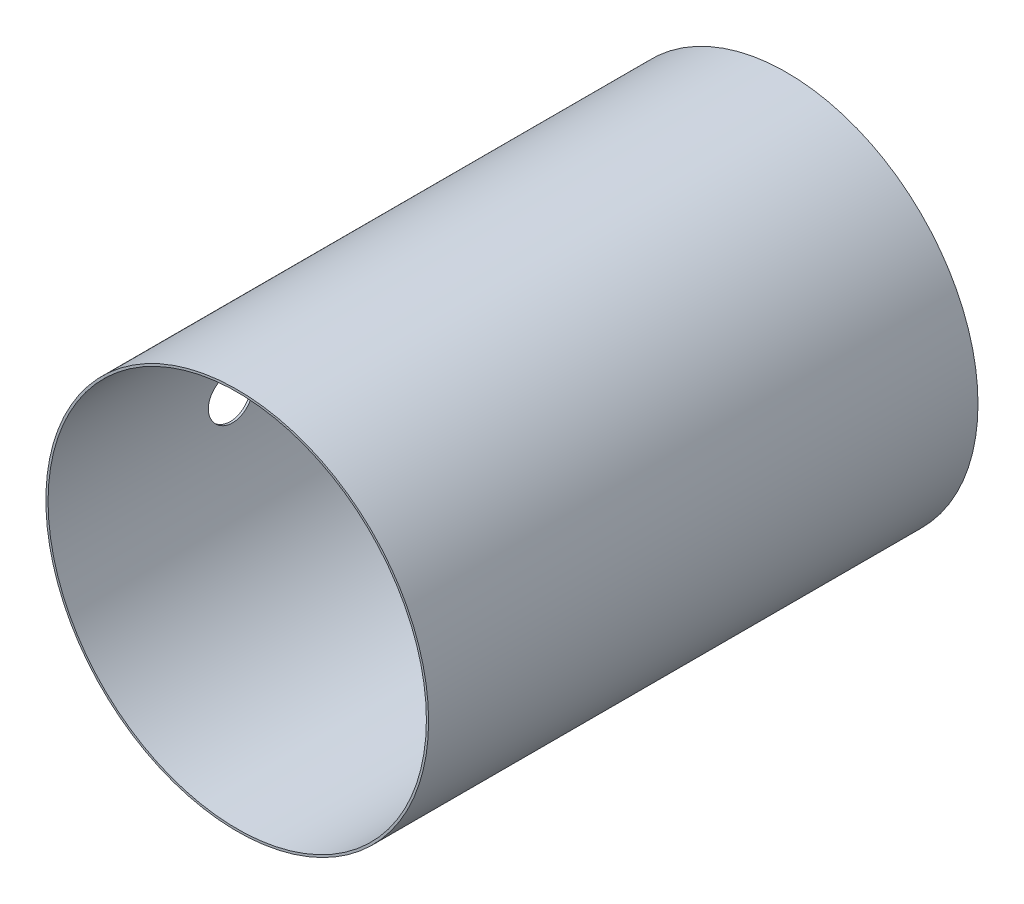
ISO-10303-21;
HEADER;
FILE_DESCRIPTION(('STEP AP214'),'2;1');
FILE_NAME('part.step','',(''),(''),'','','');
FILE_SCHEMA(('AUTOMOTIVE_DESIGN { 1 0 10303 214 1 1 1 1 }'));
ENDSEC;
DATA;
#1=APPLICATION_CONTEXT('core data for automotive mechanical design processes');
#2=APPLICATION_PROTOCOL_DEFINITION('international standard','automotive_design',2000,#1);
#3=PRODUCT_CONTEXT('',#1,'mechanical');
#4=PRODUCT('Part','Part','',(#3));
#5=PRODUCT_RELATED_PRODUCT_CATEGORY('part','',(#4));
#6=PRODUCT_DEFINITION_FORMATION('','',#4);
#7=PRODUCT_DEFINITION_CONTEXT('part definition',#1,'design');
#8=PRODUCT_DEFINITION('design','',#6,#7);
#9=PRODUCT_DEFINITION_SHAPE('','',#8);
#10=(LENGTH_UNIT() NAMED_UNIT(*) SI_UNIT(.MILLI.,.METRE.));
#11=(NAMED_UNIT(*) PLANE_ANGLE_UNIT() SI_UNIT($,.RADIAN.));
#12=(NAMED_UNIT(*) SI_UNIT($,.STERADIAN.) SOLID_ANGLE_UNIT());
#13=UNCERTAINTY_MEASURE_WITH_UNIT(LENGTH_MEASURE(1.E-05),#10,'distance_accuracy_value','');
#14=(GEOMETRIC_REPRESENTATION_CONTEXT(3) GLOBAL_UNCERTAINTY_ASSIGNED_CONTEXT((#13)) GLOBAL_UNIT_ASSIGNED_CONTEXT((#10,
#11,#12)) REPRESENTATION_CONTEXT('',''));
#15=CARTESIAN_POINT('',(0.,0.,0.));
#16=DIRECTION('',(0.,0.,1.));
#17=DIRECTION('',(1.,0.,0.));
#18=AXIS2_PLACEMENT_3D('',#15,#16,#17);
#19=CARTESIAN_POINT('',(0.,0.,1500.));
#20=DIRECTION('',(0.,0.,1.));
#21=DIRECTION('',(1.,0.,0.));
#22=AXIS2_PLACEMENT_3D('',#19,#20,#21);
#23=PLANE('',#22);
#24=CARTESIAN_POINT('',(0.,0.,1500.));
#25=DIRECTION('',(0.,0.,1.));
#26=DIRECTION('',(1.,0.,0.));
#27=AXIS2_PLACEMENT_3D('',#24,#25,#26);
#28=CIRCLE('',#27,522.5);
#29=CARTESIAN_POINT('',(522.5,0.,1500.));
#30=VERTEX_POINT('',#29);
#31=EDGE_CURVE('E12',#30,#30,#28,.T.);
#32=ORIENTED_EDGE('',*,*,#31,.T.);
#33=EDGE_LOOP('',(#32));
#34=FACE_BOUND('',#33,.T.);
#35=CARTESIAN_POINT('',(0.,0.,1500.));
#36=DIRECTION('',(0.,0.,1.));
#37=DIRECTION('',(1.,0.,0.));
#38=AXIS2_PLACEMENT_3D('',#35,#36,#37);
#39=CIRCLE('',#38,516.5);
#40=CARTESIAN_POINT('',(516.5,0.,1500.));
#41=VERTEX_POINT('',#40);
#42=EDGE_CURVE('E70',#41,#41,#39,.T.);
#43=ORIENTED_EDGE('',*,*,#42,.F.);
#44=EDGE_LOOP('',(#43));
#45=FACE_BOUND('',#44,.T.);
#46=ADVANCED_FACE('F48',(#34,#45),#23,.T.);
#47=CARTESIAN_POINT('',(0.,0.,0.));
#48=DIRECTION('',(0.,0.,1.));
#49=DIRECTION('',(1.,0.,0.));
#50=AXIS2_PLACEMENT_3D('',#47,#48,#49);
#51=PLANE('',#50);
#52=CARTESIAN_POINT('',(0.,0.,0.));
#53=DIRECTION('',(0.,0.,1.));
#54=DIRECTION('',(1.,0.,0.));
#55=AXIS2_PLACEMENT_3D('',#52,#53,#54);
#56=CIRCLE('',#55,522.5);
#57=CARTESIAN_POINT('',(522.5,0.,0.));
#58=VERTEX_POINT('',#57);
#59=EDGE_CURVE('E63',#58,#58,#56,.T.);
#60=ORIENTED_EDGE('',*,*,#59,.F.);
#61=EDGE_LOOP('',(#60));
#62=FACE_BOUND('',#61,.T.);
#63=CARTESIAN_POINT('',(0.,0.,0.));
#64=DIRECTION('',(0.,0.,1.));
#65=DIRECTION('',(1.,0.,0.));
#66=AXIS2_PLACEMENT_3D('',#63,#64,#65);
#67=CIRCLE('',#66,516.5);
#68=CARTESIAN_POINT('',(516.5,0.,0.));
#69=VERTEX_POINT('',#68);
#70=EDGE_CURVE('E73',#69,#69,#67,.T.);
#71=ORIENTED_EDGE('',*,*,#70,.T.);
#72=EDGE_LOOP('',(#71));
#73=FACE_BOUND('',#72,.T.);
#74=ADVANCED_FACE('F116',(#62,#73),#51,.F.);
#75=CARTESIAN_POINT('',(0.,0.,1500.));
#76=DIRECTION('',(0.,0.,-1.));
#77=DIRECTION('',(-1.,0.,0.));
#78=AXIS2_PLACEMENT_3D('',#75,#76,#77);
#79=CYLINDRICAL_SURFACE('',#78,522.5);
#80=CARTESIAN_POINT('',(-522.5,0.,937.5));
#81=CARTESIAN_POINT('',(-522.499996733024,1.74890557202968,937.500011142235));
#82=CARTESIAN_POINT('',(-522.491195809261,3.49810491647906,937.57347101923));
#83=CARTESIAN_POINT('',(-522.456228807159,6.98425113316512,937.866823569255));
#84=CARTESIAN_POINT('',(-522.430058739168,8.72119509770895,938.086749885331));
#85=CARTESIAN_POINT('',(-522.361058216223,12.1719122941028,938.67170652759));
#86=CARTESIAN_POINT('',(-522.318211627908,13.8856614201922,939.036877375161));
#87=CARTESIAN_POINT('',(-522.217070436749,17.2759258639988,939.909599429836));
#88=CARTESIAN_POINT('',(-522.158776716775,18.9524433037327,940.417142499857));
#89=CARTESIAN_POINT('',(-522.028423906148,22.2554449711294,941.570527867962));
#90=CARTESIAN_POINT('',(-521.95637367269,23.8819606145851,942.216281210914));
#91=CARTESIAN_POINT('',(-521.800504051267,27.0746896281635,943.641615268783));
#92=CARTESIAN_POINT('',(-521.716684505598,28.6409021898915,944.421197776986));
#93=CARTESIAN_POINT('',(-521.539640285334,31.7017923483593,946.108444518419));
#94=CARTESIAN_POINT('',(-521.446417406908,33.19648352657,947.016084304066));
#95=CARTESIAN_POINT('',(-521.253157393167,36.1042863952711,948.95313521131));
#96=CARTESIAN_POINT('',(-521.153120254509,37.5173980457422,949.982546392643));
#97=CARTESIAN_POINT('',(-520.9485619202,40.2584597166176,952.160844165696));
#98=CARTESIAN_POINT('',(-520.844022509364,41.5859961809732,953.31024947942));
#99=CARTESIAN_POINT('',(-520.633828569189,44.1396459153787,955.716599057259));
#100=CARTESIAN_POINT('',(-520.528174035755,45.3657588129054,956.973543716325));
#101=CARTESIAN_POINT('',(-520.318724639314,47.7080480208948,959.586259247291));
#102=CARTESIAN_POINT('',(-520.214929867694,48.8242189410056,960.942034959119));
#103=CARTESIAN_POINT('',(-520.012140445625,50.9387109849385,963.742908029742));
#104=CARTESIAN_POINT('',(-519.913145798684,51.937032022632,965.188005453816));
#105=CARTESIAN_POINT('',(-519.722472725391,53.8116356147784,968.162018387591));
#106=CARTESIAN_POINT('',(-519.6308177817,54.687532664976,969.691178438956));
#107=CARTESIAN_POINT('',(-519.457793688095,56.3073208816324,972.81845292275));
#108=CARTESIAN_POINT('',(-519.376424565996,57.0512116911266,974.416567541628));
#109=CARTESIAN_POINT('',(-519.226319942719,58.4015453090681,977.670376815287));
#110=CARTESIAN_POINT('',(-519.157584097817,59.0079918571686,979.326069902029));
#111=CARTESIAN_POINT('',(-519.034734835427,60.0789885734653,982.683258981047));
#112=CARTESIAN_POINT('',(-518.980621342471,60.5435394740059,984.384754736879));
#113=CARTESIAN_POINT('',(-518.888811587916,61.3254073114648,987.813089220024));
#114=CARTESIAN_POINT('',(-518.851037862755,61.6434194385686,989.539767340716));
#115=CARTESIAN_POINT('',(-518.792624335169,62.1331142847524,993.0140382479));
#116=CARTESIAN_POINT('',(-518.771984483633,62.3047974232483,994.761630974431));
#117=CARTESIAN_POINT('',(-518.748437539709,62.5005465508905,998.265126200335));
#118=CARTESIAN_POINT('',(-518.745529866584,62.5246173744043,1000.02102842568));
#119=CARTESIAN_POINT('',(-518.757530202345,62.4249738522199,1003.5285704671));
#120=CARTESIAN_POINT('',(-518.77243816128,62.3012599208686,1005.28021029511));
#121=CARTESIAN_POINT('',(-518.819513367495,61.9080075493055,1008.75752307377));
#122=CARTESIAN_POINT('',(-518.851590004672,61.6392346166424,1010.48328389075));
#123=CARTESIAN_POINT('',(-518.932025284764,60.9583503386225,1013.90589738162));
#124=CARTESIAN_POINT('',(-518.980383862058,60.5462395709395,1015.60275017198));
#125=CARTESIAN_POINT('',(-519.092002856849,59.5816919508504,1018.95560725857));
#126=CARTESIAN_POINT('',(-519.155263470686,59.0292532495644,1020.61161101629));
#127=CARTESIAN_POINT('',(-519.294887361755,57.7880581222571,1023.87114703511));
#128=CARTESIAN_POINT('',(-519.371250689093,57.0993011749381,1025.47467909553));
#129=CARTESIAN_POINT('',(-519.535126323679,55.5884967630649,1028.62208804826));
#130=CARTESIAN_POINT('',(-519.622666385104,54.7661160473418,1030.16580352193));
#131=CARTESIAN_POINT('',(-519.806265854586,52.9951702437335,1033.17853463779));
#132=CARTESIAN_POINT('',(-519.902325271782,52.0466050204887,1034.64755019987));
#133=CARTESIAN_POINT('',(-520.100260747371,50.0299401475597,1037.50076181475));
#134=CARTESIAN_POINT('',(-520.202137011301,48.9618362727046,1038.88495486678));
#135=CARTESIAN_POINT('',(-520.408844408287,46.7135803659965,1041.55890537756));
#136=CARTESIAN_POINT('',(-520.513675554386,45.5334278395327,1042.8486624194));
#137=CARTESIAN_POINT('',(-520.724023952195,43.0614545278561,1045.33266746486));
#138=CARTESIAN_POINT('',(-520.829541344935,41.7689739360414,1046.52625894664));
#139=CARTESIAN_POINT('',(-521.037613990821,39.0878787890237,1048.80038668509));
#140=CARTESIAN_POINT('',(-521.140169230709,37.6992638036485,1049.88092243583));
#141=CARTESIAN_POINT('',(-521.339418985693,34.8356116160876,1051.92129683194));
#142=CARTESIAN_POINT('',(-521.436113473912,33.3605740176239,1052.88113492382));
#143=CARTESIAN_POINT('',(-521.620906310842,30.334429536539,1054.67325374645));
#144=CARTESIAN_POINT('',(-521.70900467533,28.783322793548,1055.50553471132));
#145=CARTESIAN_POINT('',(-521.874135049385,25.6154867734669,1057.0367663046));
#146=CARTESIAN_POINT('',(-521.951163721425,23.9987378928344,1057.73567674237));
#147=CARTESIAN_POINT('',(-522.091935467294,20.7115186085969,1058.99475186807));
#148=CARTESIAN_POINT('',(-522.155678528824,19.0410481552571,1059.55491642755));
#149=CARTESIAN_POINT('',(-522.268062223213,15.6583719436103,1060.53234453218));
#150=CARTESIAN_POINT('',(-522.316703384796,13.9461676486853,1060.94961308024));
#151=CARTESIAN_POINT('',(-522.39749806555,10.4922710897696,1061.6381624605));
#152=CARTESIAN_POINT('',(-522.429651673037,8.75057898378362,1061.90944407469));
#153=CARTESIAN_POINT('',(-522.476408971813,5.26100703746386,1062.30277582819));
#154=CARTESIAN_POINT('',(-522.491118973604,3.51323047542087,1062.42573003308));
#155=CARTESIAN_POINT('',(-522.502930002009,0.0134684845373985,1062.52450964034));
#156=CARTESIAN_POINT('',(-522.500031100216,-1.73851692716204,1062.5003356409));
#157=CARTESIAN_POINT('',(-522.476706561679,-5.2341257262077,1062.30504186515));
#158=CARTESIAN_POINT('',(-522.456281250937,-6.97774926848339,1062.13392482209));
#159=CARTESIAN_POINT('',(-522.398481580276,-10.4442078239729,1061.64602271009));
#160=CARTESIAN_POINT('',(-522.361107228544,-12.1670428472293,1061.32923771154));
#161=CARTESIAN_POINT('',(-522.270600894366,-15.5745217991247,1060.55351586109));
#162=CARTESIAN_POINT('',(-522.217516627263,-17.2592649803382,1060.09500927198));
#163=CARTESIAN_POINT('',(-522.097035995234,-20.5840327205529,1059.03888522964));
#164=CARTESIAN_POINT('',(-522.029639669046,-22.224057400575,1058.44126815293));
#165=CARTESIAN_POINT('',(-521.882415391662,-25.4479606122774,1057.11122510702));
#166=CARTESIAN_POINT('',(-521.802587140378,-27.031837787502,1056.37879588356));
#167=CARTESIAN_POINT('',(-521.632724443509,-30.1324040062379,1054.78437004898));
#168=CARTESIAN_POINT('',(-521.542689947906,-31.6490927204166,1053.92237280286));
#169=CARTESIAN_POINT('',(-521.354473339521,-34.6118072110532,1052.07051945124));
#170=CARTESIAN_POINT('',(-521.256254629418,-36.0574639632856,1051.08007665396));
#171=CARTESIAN_POINT('',(-521.054795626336,-38.8603210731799,1048.98153179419));
#172=CARTESIAN_POINT('',(-520.951555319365,-40.2175211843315,1047.87342940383));
#173=CARTESIAN_POINT('',(-520.742944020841,-42.8340895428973,1045.5472854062));
#174=CARTESIAN_POINT('',(-520.637572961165,-44.0934546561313,1044.32924027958));
#175=CARTESIAN_POINT('',(-520.427660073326,-46.5055550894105,1041.79171787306));
#176=CARTESIAN_POINT('',(-520.323118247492,-47.6582901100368,1040.47224030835));
#177=CARTESIAN_POINT('',(-520.117268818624,-49.8547910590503,1037.73389169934));
#178=CARTESIAN_POINT('',(-520.015980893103,-50.8979582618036,1036.31453883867));
#179=CARTESIAN_POINT('',(-519.82010117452,-52.8610048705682,1033.39254523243));
#180=CARTESIAN_POINT('',(-519.725509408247,-53.7808837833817,1031.88990415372));
#181=CARTESIAN_POINT('',(-519.545731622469,-55.4907390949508,1028.81192805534));
#182=CARTESIAN_POINT('',(-519.460545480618,-56.2807171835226,1027.23659398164));
#183=CARTESIAN_POINT('',(-519.302028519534,-57.7250495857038,1024.02435746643));
#184=CARTESIAN_POINT('',(-519.228697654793,-58.3794044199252,1022.38745526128));
#185=CARTESIAN_POINT('',(-519.096172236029,-59.5462694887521,1019.06776698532));
#186=CARTESIAN_POINT('',(-519.036943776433,-60.0591204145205,1017.38510202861));
#187=CARTESIAN_POINT('',(-518.934106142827,-60.9412908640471,1013.98208577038));
#188=CARTESIAN_POINT('',(-518.890496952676,-61.3106105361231,1012.26173450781));
#189=CARTESIAN_POINT('',(-518.820164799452,-61.9029540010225,1008.79574668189));
#190=CARTESIAN_POINT('',(-518.79344123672,-62.1259829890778,1007.05011101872));
#191=CARTESIAN_POINT('',(-518.757655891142,-62.4240906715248,1003.54607466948));
#192=CARTESIAN_POINT('',(-518.748594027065,-62.4991700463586,1001.78767404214));
#193=CARTESIAN_POINT('',(-518.748396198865,-62.5008110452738,998.28197618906));
#194=CARTESIAN_POINT('',(-518.757146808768,-62.4283124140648,996.534679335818));
#195=CARTESIAN_POINT('',(-518.792094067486,-62.1372235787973,993.05248037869));
#196=CARTESIAN_POINT('',(-518.81829063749,-61.9186340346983,991.317578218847));
#197=CARTESIAN_POINT('',(-518.88737689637,-61.3369847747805,987.872509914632));
#198=CARTESIAN_POINT('',(-518.930266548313,-60.973925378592,986.162343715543));
#199=CARTESIAN_POINT('',(-519.031509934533,-60.1060092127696,982.778850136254));
#200=CARTESIAN_POINT('',(-519.089863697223,-59.6011521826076,981.105522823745));
#201=CARTESIAN_POINT('',(-519.220349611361,-58.4535001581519,977.807994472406));
#202=CARTESIAN_POINT('',(-519.292477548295,-57.810747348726,976.183778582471));
#203=CARTESIAN_POINT('',(-519.44847520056,-56.391849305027,972.995291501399));
#204=CARTESIAN_POINT('',(-519.532344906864,-55.6157041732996,971.431020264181));
#205=CARTESIAN_POINT('',(-519.709456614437,-53.9355531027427,968.373281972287));
#206=CARTESIAN_POINT('',(-519.802698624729,-53.0315470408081,966.879814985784));
#207=CARTESIAN_POINT('',(-519.995933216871,-51.1020460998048,963.974000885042));
#208=CARTESIAN_POINT('',(-520.095925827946,-50.0765506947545,962.561654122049));
#209=CARTESIAN_POINT('',(-520.30048512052,-47.9046113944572,959.819456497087));
#210=CARTESIAN_POINT('',(-520.405076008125,-46.757467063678,958.490162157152));
#211=CARTESIAN_POINT('',(-520.615303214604,-44.3554850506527,955.932796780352));
#212=CARTESIAN_POINT('',(-520.720939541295,-43.1006465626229,954.704726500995));
#213=CARTESIAN_POINT('',(-520.930305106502,-40.4917246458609,952.358114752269));
#214=CARTESIAN_POINT('',(-521.034033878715,-39.1376173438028,951.239599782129));
#215=CARTESIAN_POINT('',(-521.23663472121,-36.3398851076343,949.120314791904));
#216=CARTESIAN_POINT('',(-521.335506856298,-34.8962613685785,948.119543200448));
#217=CARTESIAN_POINT('',(-521.525941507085,-31.9243906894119,946.23955328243));
#218=CARTESIAN_POINT('',(-521.617477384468,-30.3958667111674,945.360770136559));
#219=CARTESIAN_POINT('',(-521.79026042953,-27.2694839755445,943.735184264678));
#220=CARTESIAN_POINT('',(-521.87150696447,-25.6716209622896,942.988389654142));
#221=CARTESIAN_POINT('',(-522.021316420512,-22.4196806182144,941.632987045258));
#222=CARTESIAN_POINT('',(-522.089892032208,-20.7656615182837,941.02424064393));
#223=CARTESIAN_POINT('',(-522.212495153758,-17.4118726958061,939.94855287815));
#224=CARTESIAN_POINT('',(-522.266526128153,-15.7121139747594,939.481577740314));
#225=CARTESIAN_POINT('',(-522.343234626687,-12.8495909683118,938.823844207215));
#226=CARTESIAN_POINT('',(-522.370365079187,-11.6960171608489,938.592860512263));
#227=CARTESIAN_POINT('',(-522.417131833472,-9.37733793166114,938.196288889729));
#228=CARTESIAN_POINT('',(-522.43676734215,-8.21223130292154,938.030707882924));
#229=CARTESIAN_POINT('',(-522.468283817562,-5.874431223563,937.765564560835));
#230=CARTESIAN_POINT('',(-522.480164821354,-4.70173780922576,937.666001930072));
#231=CARTESIAN_POINT('',(-522.496023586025,-2.35274030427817,937.53321947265));
#232=CARTESIAN_POINT('',(-522.500002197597,-1.17643661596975,937.499992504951));
#233=CARTESIAN_POINT('',(-522.5,0.,937.5));
#234=B_SPLINE_CURVE_WITH_KNOTS('',3,(#80,#81,#82,#83,#84,#85,#86,#87,#88,#89,#90,#91,#92,#93,
#94,#95,#96,#97,#98,#99,#100,#101,#102,#103,#104,#105,#106,#107,#108,#109,#110,#111,#112,#113,
#114,#115,#116,#117,#118,#119,#120,#121,#122,#123,#124,#125,#126,#127,#128,#129,#130,#131,#132,
#133,#134,#135,#136,#137,#138,#139,#140,#141,#142,#143,#144,#145,#146,#147,#148,#149,#150,#151,
#152,#153,#154,#155,#156,#157,#158,#159,#160,#161,#162,#163,#164,#165,#166,#167,#168,#169,#170,
#171,#172,#173,#174,#175,#176,#177,#178,#179,#180,#181,#182,#183,#184,#185,#186,#187,#188,#189,
#190,#191,#192,#193,#194,#195,#196,#197,#198,#199,#200,#201,#202,#203,#204,#205,#206,#207,#208,
#209,#210,#211,#212,#213,#214,#215,#216,#217,#218,#219,#220,#221,#222,#223,#224,#225,#226,#227,
#228,#229,#230,#231,#232,#233),.UNSPECIFIED.,.T.,.F.,(4,2,2,2,2,2,2,2,2,2,2,2,2,2,2,2,2,2,2,2,2,
2,2,2,2,2,2,2,2,2,2,2,2,2,2,2,2,2,2,2,2,2,2,2,2,2,2,2,2,2,2,2,2,2,2,2,2,2,2,2,2,2,2,2,2,2,2,2,2,
2,2,2,2,2,2,2,4),(0.,5.24566454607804,10.4925344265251,15.7444929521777,20.996151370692,
26.2444398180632,31.4927985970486,36.7401567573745,41.987517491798,47.2585831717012,
52.5296682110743,57.8010115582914,63.0723587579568,68.3599480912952,73.6475517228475,
78.9350114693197,84.2224439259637,89.4845274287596,94.7465958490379,100.00849193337,
105.27037326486,110.504754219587,115.739114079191,120.97354290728,126.207991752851,
131.455701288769,136.703416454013,141.951317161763,147.199241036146,152.480396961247,
157.761576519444,163.042780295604,168.323974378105,173.60675742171,178.889545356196,
184.172148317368,189.454722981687,194.704934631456,199.955124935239,205.205217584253,
210.455307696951,215.689612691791,220.92390351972,226.158320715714,231.392763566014,
236.652018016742,241.911287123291,247.170724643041,252.430176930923,257.717018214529,
263.003880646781,268.290674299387,273.577447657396,278.851379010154,284.12530491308,
289.399043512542,294.672757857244,299.912995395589,305.153209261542,310.393411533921,
315.633623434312,320.872234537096,326.110841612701,331.349453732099,336.588088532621,
341.858718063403,347.129387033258,352.401327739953,357.673198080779,362.963416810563,
368.25396070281,373.539176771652,378.82313278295,382.351758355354,385.880757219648,
389.409739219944,392.938341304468),.UNSPECIFIED.);
#235=CARTESIAN_POINT('',(-522.5,0.,937.5));
#236=VERTEX_POINT('',#235);
#237=EDGE_CURVE('E100',#236,#236,#234,.T.);
#238=ORIENTED_EDGE('',*,*,#237,.T.);
#239=EDGE_LOOP('',(#238));
#240=FACE_BOUND('',#239,.T.);
#241=CARTESIAN_POINT('',(-522.5,0.,207.5));
#242=CARTESIAN_POINT('',(-522.500000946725,1.15111111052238,207.499997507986));
#243=CARTESIAN_POINT('',(-522.496194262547,2.30216042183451,207.524093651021));
#244=CARTESIAN_POINT('',(-522.480996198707,4.60228855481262,207.620428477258));
#245=CARTESIAN_POINT('',(-522.469604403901,5.75136726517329,207.692669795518));
#246=CARTESIAN_POINT('',(-522.439312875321,8.04553783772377,207.885174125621));
#247=CARTESIAN_POINT('',(-522.420412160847,9.19062915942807,208.00544341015));
#248=CARTESIAN_POINT('',(-522.375234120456,11.4747407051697,208.293785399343));
#249=CARTESIAN_POINT('',(-522.348956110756,12.6137603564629,208.461862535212));
#250=CARTESIAN_POINT('',(-522.289185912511,14.8844619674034,208.84564295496));
#251=CARTESIAN_POINT('',(-522.255688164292,16.0161375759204,209.061382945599));
#252=CARTESIAN_POINT('',(-522.181722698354,18.2693519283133,209.540025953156));
#253=CARTESIAN_POINT('',(-522.141254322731,19.3908897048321,209.802933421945));
#254=CARTESIAN_POINT('',(-522.053640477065,21.621567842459,210.375358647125));
#255=CARTESIAN_POINT('',(-522.006495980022,22.7307099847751,210.684869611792));
#256=CARTESIAN_POINT('',(-521.90585128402,24.9349089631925,211.349979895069));
#257=CARTESIAN_POINT('',(-521.8523504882,26.0299644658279,211.70558354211));
#258=CARTESIAN_POINT('',(-521.739420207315,28.2030156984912,212.461865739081));
#259=CARTESIAN_POINT('',(-521.679995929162,29.2810254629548,212.862504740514));
#260=CARTESIAN_POINT('',(-521.555588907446,31.4191766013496,213.708405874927));
#261=CARTESIAN_POINT('',(-521.490605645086,32.4793162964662,214.153672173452));
#262=CARTESIAN_POINT('',(-521.355540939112,34.5797215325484,215.087960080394));
#263=CARTESIAN_POINT('',(-521.28545991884,35.6199887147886,215.576978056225));
#264=CARTESIAN_POINT('',(-521.140683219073,37.6789615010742,216.597909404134));
#265=CARTESIAN_POINT('',(-521.065987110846,38.6976650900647,217.129826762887));
#266=CARTESIAN_POINT('',(-520.835778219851,41.7182913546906,218.788289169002));
#267=CARTESIAN_POINT('',(-520.674088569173,43.6855951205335,219.977929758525));
#268=CARTESIAN_POINT('',(-520.338778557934,47.5131465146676,222.516472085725));
#269=CARTESIAN_POINT('',(-520.165158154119,49.373393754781,223.865374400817));
#270=CARTESIAN_POINT('',(-519.809381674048,52.9884971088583,226.724256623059));
#271=CARTESIAN_POINT('',(-519.627170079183,54.742429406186,228.235398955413));
#272=CARTESIAN_POINT('',(-519.260574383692,58.1170159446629,231.3995496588));
#273=CARTESIAN_POINT('',(-519.076190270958,59.7376694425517,233.052558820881));
#274=CARTESIAN_POINT('',(-518.710411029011,62.8346364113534,236.489169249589));
#275=CARTESIAN_POINT('',(-518.529016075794,64.3109414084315,238.272778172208));
#276=CARTESIAN_POINT('',(-518.174339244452,67.1088176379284,241.958254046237));
#277=CARTESIAN_POINT('',(-518.001057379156,68.430388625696,243.860121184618));
#278=CARTESIAN_POINT('',(-517.666602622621,70.9162944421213,247.779808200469));
#279=CARTESIAN_POINT('',(-517.505501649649,72.0797235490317,249.798208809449));
#280=CARTESIAN_POINT('',(-517.201127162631,74.2322455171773,253.927236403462));
#281=CARTESIAN_POINT('',(-517.057853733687,75.2213375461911,256.037863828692));
#282=CARTESIAN_POINT('',(-516.793317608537,77.017801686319,260.336319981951));
#283=CARTESIAN_POINT('',(-516.672053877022,77.8251823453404,262.524145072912));
#284=CARTESIAN_POINT('',(-516.455095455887,79.2521658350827,266.961434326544));
#285=CARTESIAN_POINT('',(-516.359400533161,79.8717703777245,269.210897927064));
#286=CARTESIAN_POINT('',(-516.197089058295,80.9140990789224,273.736375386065));
#287=CARTESIAN_POINT('',(-516.130238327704,81.3384107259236,276.012015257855));
#288=CARTESIAN_POINT('',(-516.026432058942,81.9944021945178,280.591569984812));
#289=CARTESIAN_POINT('',(-515.989476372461,82.2260829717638,282.89548469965));
#290=CARTESIAN_POINT('',(-515.946550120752,82.4950062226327,287.514792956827));
#291=CARTESIAN_POINT('',(-515.940577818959,82.5322595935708,289.830185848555));
#292=CARTESIAN_POINT('',(-515.959790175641,82.4120659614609,294.45577579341));
#293=CARTESIAN_POINT('',(-515.984974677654,82.2546199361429,296.765972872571));
#294=CARTESIAN_POINT('',(-516.065383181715,81.7486082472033,301.343185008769));
#295=CARTESIAN_POINT('',(-516.120327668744,81.4018206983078,303.610401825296));
#296=CARTESIAN_POINT('',(-516.258483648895,80.5209693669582,308.107259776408));
#297=CARTESIAN_POINT('',(-516.341694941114,79.9869069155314,310.336901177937));
#298=CARTESIAN_POINT('',(-516.533999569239,78.7354912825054,314.743031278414));
#299=CARTESIAN_POINT('',(-516.643093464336,78.0181341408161,316.919518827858));
#300=CARTESIAN_POINT('',(-516.884055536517,76.4054141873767,321.204208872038));
#301=CARTESIAN_POINT('',(-517.015923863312,75.510050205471,323.312410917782));
#302=CARTESIAN_POINT('',(-517.299322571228,73.5435341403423,327.455018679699));
#303=CARTESIAN_POINT('',(-517.45093558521,72.4716379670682,329.489065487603));
#304=CARTESIAN_POINT('',(-517.769094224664,70.1624739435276,333.459774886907));
#305=CARTESIAN_POINT('',(-517.93563987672,68.9252057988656,335.396437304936));
#306=CARTESIAN_POINT('',(-518.279008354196,66.2938860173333,339.159351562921));
#307=CARTESIAN_POINT('',(-518.45583180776,64.8998247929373,340.98559664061));
#308=CARTESIAN_POINT('',(-518.814827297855,61.9645900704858,344.515210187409));
#309=CARTESIAN_POINT('',(-518.9969993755,60.4234154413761,346.218577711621));
#310=CARTESIAN_POINT('',(-519.363677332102,57.1865559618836,349.50909950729));
#311=CARTESIAN_POINT('',(-519.548186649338,55.4893444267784,351.094752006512));
#312=CARTESIAN_POINT('',(-519.912315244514,51.9669955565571,354.117607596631));
#313=CARTESIAN_POINT('',(-520.091934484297,50.1418572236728,355.554809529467));
#314=CARTESIAN_POINT('',(-520.441223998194,46.3762555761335,358.270651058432));
#315=CARTESIAN_POINT('',(-520.610894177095,44.4357911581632,359.549289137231));
#316=CARTESIAN_POINT('',(-520.935499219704,40.4530208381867,361.938836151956));
#317=CARTESIAN_POINT('',(-521.090434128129,38.4107152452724,363.049745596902));
#318=CARTESIAN_POINT('',(-521.381293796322,34.2370409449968,365.096477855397));
#319=CARTESIAN_POINT('',(-521.517204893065,32.1056096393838,366.032174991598));
#320=CARTESIAN_POINT('',(-521.766024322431,27.7701253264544,367.720536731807));
#321=CARTESIAN_POINT('',(-521.878932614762,25.5660721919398,368.47320101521));
#322=CARTESIAN_POINT('',(-522.078518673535,21.1012600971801,369.789745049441));
#323=CARTESIAN_POINT('',(-522.165198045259,18.8405046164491,370.35363635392));
#324=CARTESIAN_POINT('',(-522.309851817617,14.2785263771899,371.288343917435));
#325=CARTESIAN_POINT('',(-522.367826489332,11.9773040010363,371.659161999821));
#326=CARTESIAN_POINT('',(-522.452954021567,7.37565983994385,372.201948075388));
#327=CARTESIAN_POINT('',(-522.480426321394,5.07548690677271,372.375977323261));
#328=CARTESIAN_POINT('',(-522.504867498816,0.468491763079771,372.530857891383));
#329=CARTESIAN_POINT('',(-522.501836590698,-1.83833040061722,372.511710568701));
#330=CARTESIAN_POINT('',(-522.465357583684,-6.44195337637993,372.28039148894));
#331=CARTESIAN_POINT('',(-522.431910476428,-8.73875451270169,372.068226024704));
#332=CARTESIAN_POINT('',(-522.335543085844,-13.3059268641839,371.452512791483));
#333=CARTESIAN_POINT('',(-522.272622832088,-15.5762981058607,371.048965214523));
#334=CARTESIAN_POINT('',(-522.119493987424,-20.0622550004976,370.056260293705));
#335=CARTESIAN_POINT('',(-522.029434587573,-22.2780702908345,369.468117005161));
#336=CARTESIAN_POINT('',(-521.824408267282,-26.6520304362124,368.109943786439));
#337=CARTESIAN_POINT('',(-521.70944146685,-28.8101755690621,367.339914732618));
#338=CARTESIAN_POINT('',(-521.457768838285,-33.0539606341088,365.623573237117));
#339=CARTESIAN_POINT('',(-521.321062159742,-35.1395977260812,364.677253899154));
#340=CARTESIAN_POINT('',(-521.029671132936,-39.2240278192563,362.615146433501));
#341=CARTESIAN_POINT('',(-520.87498663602,-41.2228201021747,361.499356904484));
#342=CARTESIAN_POINT('',(-520.550584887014,-45.1356145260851,359.096592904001));
#343=CARTESIAN_POINT('',(-520.380757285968,-47.0488105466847,357.808320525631));
#344=CARTESIAN_POINT('',(-520.031858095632,-50.7601346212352,355.076630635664));
#345=CARTESIAN_POINT('',(-519.852786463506,-52.5582621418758,353.633212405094));
#346=CARTESIAN_POINT('',(-519.49035943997,-56.0273034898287,350.601142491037));
#347=CARTESIAN_POINT('',(-519.30700380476,-57.6982100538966,349.01248252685));
#348=CARTESIAN_POINT('',(-518.941115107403,-60.9012991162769,345.700883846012));
#349=CARTESIAN_POINT('',(-518.758582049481,-62.4334809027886,343.977944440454));
#350=CARTESIAN_POINT('',(-518.397765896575,-65.3620984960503,340.392982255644));
#351=CARTESIAN_POINT('',(-518.219537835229,-66.7571453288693,338.529818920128));
#352=CARTESIAN_POINT('',(-517.874198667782,-69.3853138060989,334.691588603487));
#353=CARTESIAN_POINT('',(-517.707087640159,-70.6184343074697,332.716520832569));
#354=CARTESIAN_POINT('',(-517.38879606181,-72.9138322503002,328.668296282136));
#355=CARTESIAN_POINT('',(-517.237615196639,-73.9761130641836,326.595141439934));
#356=CARTESIAN_POINT('',(-516.955568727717,-75.9220467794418,322.365294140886));
#357=CARTESIAN_POINT('',(-516.824702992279,-76.8057008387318,320.208602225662));
#358=CARTESIAN_POINT('',(-516.587573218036,-78.3847221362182,315.835422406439));
#359=CARTESIAN_POINT('',(-516.481216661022,-79.0807991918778,313.619195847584));
#360=CARTESIAN_POINT('',(-516.295579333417,-80.2838444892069,309.13487231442));
#361=CARTESIAN_POINT('',(-516.216298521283,-80.7908130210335,306.866775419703));
#362=CARTESIAN_POINT('',(-516.087156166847,-81.6117037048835,302.295230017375));
#363=CARTESIAN_POINT('',(-516.037292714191,-81.925638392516,299.991783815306));
#364=CARTESIAN_POINT('',(-515.96845659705,-82.3580594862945,295.366165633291));
#365=CARTESIAN_POINT('',(-515.949483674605,-82.4765475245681,293.043993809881));
#366=CARTESIAN_POINT('',(-515.943027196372,-82.5169251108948,288.423881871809));
#367=CARTESIAN_POINT('',(-515.955194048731,-82.4409972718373,286.125961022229));
#368=CARTESIAN_POINT('',(-516.009926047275,-82.097724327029,281.544842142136));
#369=CARTESIAN_POINT('',(-516.052490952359,-81.8303807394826,279.261643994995));
#370=CARTESIAN_POINT('',(-516.166783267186,-81.1063245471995,274.726242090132));
#371=CARTESIAN_POINT('',(-516.238510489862,-80.6496131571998,272.474038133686));
#372=CARTESIAN_POINT('',(-516.409055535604,-79.5502756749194,268.016524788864));
#373=CARTESIAN_POINT('',(-516.507873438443,-78.9076490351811,265.811215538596));
#374=CARTESIAN_POINT('',(-516.729658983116,-77.4419643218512,261.464990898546));
#375=CARTESIAN_POINT('',(-516.852603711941,-76.619077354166,259.324016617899));
#376=CARTESIAN_POINT('',(-517.119208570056,-74.7985286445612,255.119072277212));
#377=CARTESIAN_POINT('',(-517.26286866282,-73.8008672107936,253.05510208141));
#378=CARTESIAN_POINT('',(-517.566861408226,-71.637881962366,249.018200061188));
#379=CARTESIAN_POINT('',(-517.72719453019,-70.4725534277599,247.045270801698));
#380=CARTESIAN_POINT('',(-518.060053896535,-67.9824067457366,243.203829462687));
#381=CARTESIAN_POINT('',(-518.232580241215,-66.6575872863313,241.335318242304));
#382=CARTESIAN_POINT('',(-518.586914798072,-63.8427381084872,237.696044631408));
#383=CARTESIAN_POINT('',(-518.768802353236,-62.3510977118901,235.926536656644));
#384=CARTESIAN_POINT('',(-519.135049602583,-59.2243689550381,232.518965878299));
#385=CARTESIAN_POINT('',(-519.319409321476,-57.5892791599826,230.880904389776));
#386=CARTESIAN_POINT('',(-519.593888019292,-55.037936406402,228.531191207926));
#387=CARTESIAN_POINT('',(-519.68505999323,-54.1708081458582,227.765671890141));
#388=CARTESIAN_POINT('',(-519.866083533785,-52.4050802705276,226.271714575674));
#389=CARTESIAN_POINT('',(-519.955935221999,-51.5064835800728,225.543273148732));
#390=CARTESIAN_POINT('',(-520.133696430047,-49.679276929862,224.124682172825));
#391=CARTESIAN_POINT('',(-520.221605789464,-48.7506645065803,223.434535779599));
#392=CARTESIAN_POINT('',(-520.394852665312,-46.8651625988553,222.093855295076));
#393=CARTESIAN_POINT('',(-520.480190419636,-45.9082757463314,221.443317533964));
#394=CARTESIAN_POINT('',(-520.648225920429,-43.9617455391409,220.17901329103));
#395=CARTESIAN_POINT('',(-520.730903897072,-42.9719351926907,219.565501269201));
#396=CARTESIAN_POINT('',(-520.892463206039,-40.9670968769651,218.380850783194));
#397=CARTESIAN_POINT('',(-520.9713448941,-39.9520712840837,217.809708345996));
#398=CARTESIAN_POINT('',(-521.124770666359,-37.8983361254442,216.710691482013));
#399=CARTESIAN_POINT('',(-521.199314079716,-36.8596229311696,216.18282374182));
#400=CARTESIAN_POINT('',(-521.343511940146,-34.7605970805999,215.171476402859));
#401=CARTESIAN_POINT('',(-521.413166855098,-33.7002865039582,214.687992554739));
#402=CARTESIAN_POINT('',(-521.547042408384,-31.5607424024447,213.766640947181));
#403=CARTESIAN_POINT('',(-521.611267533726,-30.4815254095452,213.328735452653));
#404=CARTESIAN_POINT('',(-521.733883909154,-28.3053350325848,212.4989420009));
#405=CARTESIAN_POINT('',(-521.792275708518,-27.2083633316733,212.107049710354));
#406=CARTESIAN_POINT('',(-521.902806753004,-24.9986749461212,211.370028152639));
#407=CARTESIAN_POINT('',(-521.954946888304,-23.8859605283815,211.024892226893));
#408=CARTESIAN_POINT('',(-522.052607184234,-21.6467424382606,210.382002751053));
#409=CARTESIAN_POINT('',(-522.098127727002,-20.5202395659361,210.084246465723));
#410=CARTESIAN_POINT('',(-522.199006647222,-17.8033680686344,209.427383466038));
#411=CARTESIAN_POINT('',(-522.251042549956,-16.2072714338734,209.091206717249));
#412=CARTESIAN_POINT('',(-522.340785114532,-12.9974127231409,208.513946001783));
#413=CARTESIAN_POINT('',(-522.378489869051,-11.3836483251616,208.272874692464));
#414=CARTESIAN_POINT('',(-522.439032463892,-8.14440909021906,207.886791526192));
#415=CARTESIAN_POINT('',(-522.461870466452,-6.51893438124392,207.741778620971));
#416=CARTESIAN_POINT('',(-522.492352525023,-3.26226454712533,207.5483912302));
#417=CARTESIAN_POINT('',(-522.499998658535,-1.63107023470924,207.500003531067));
#418=CARTESIAN_POINT('',(-522.5,0.,207.5));
#419=B_SPLINE_CURVE_WITH_KNOTS('',3,(#241,#242,#243,#244,#245,#246,#247,#248,#249,#250,#251,
#252,#253,#254,#255,#256,#257,#258,#259,#260,#261,#262,#263,#264,#265,#266,#267,#268,#269,#270,
#271,#272,#273,#274,#275,#276,#277,#278,#279,#280,#281,#282,#283,#284,#285,#286,#287,#288,#289,
#290,#291,#292,#293,#294,#295,#296,#297,#298,#299,#300,#301,#302,#303,#304,#305,#306,#307,#308,
#309,#310,#311,#312,#313,#314,#315,#316,#317,#318,#319,#320,#321,#322,#323,#324,#325,#326,#327,
#328,#329,#330,#331,#332,#333,#334,#335,#336,#337,#338,#339,#340,#341,#342,#343,#344,#345,#346,
#347,#348,#349,#350,#351,#352,#353,#354,#355,#356,#357,#358,#359,#360,#361,#362,#363,#364,#365,
#366,#367,#368,#369,#370,#371,#372,#373,#374,#375,#376,#377,#378,#379,#380,#381,#382,#383,#384,
#385,#386,#387,#388,#389,#390,#391,#392,#393,#394,#395,#396,#397,#398,#399,#400,#401,#402,#403,
#404,#405,#406,#407,#408,#409,#410,#411,#412,#413,#414,#415,#416,#417,#418),.UNSPECIFIED.,.T.,
.F.,(4,2,2,2,2,2,2,2,2,2,2,2,2,2,2,2,2,2,2,2,2,2,2,2,2,2,2,2,2,2,2,2,2,2,2,2,2,2,2,2,2,2,2,2,2,
2,2,2,2,2,2,2,2,2,2,2,2,2,2,2,2,2,2,2,2,2,2,2,2,2,2,2,2,2,2,2,2,2,2,2,2,2,2,2,2,2,2,2,4),(0.,
3.45296801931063,6.90612504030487,10.3597332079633,13.813661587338,17.2702592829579,
20.7271833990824,24.1836042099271,27.6403498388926,31.0940832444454,34.5481393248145,
38.00190888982,41.4559997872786,48.3613431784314,55.2667116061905,62.225354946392,
69.1840370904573,76.1431274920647,83.1022288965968,90.0996436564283,97.0970918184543,
104.09421074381,111.091265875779,118.030392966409,124.96948563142,131.908189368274,
138.846858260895,145.721459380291,152.596011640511,159.470712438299,166.345458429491,
173.249960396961,180.154474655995,187.059411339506,193.964401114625,200.946122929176,
207.92789920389,214.909742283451,221.891564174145,228.878375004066,235.86519807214,
242.85159344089,249.837922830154,256.750376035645,263.662780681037,270.574959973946,
277.487132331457,284.36197913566,291.2367928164,298.111875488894,304.987015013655,
311.917148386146,318.847313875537,325.777874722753,332.708471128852,339.703269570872,
346.698117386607,353.692827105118,360.687491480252,367.655303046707,374.623103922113,
381.590452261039,388.557742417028,395.447157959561,402.336518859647,409.225835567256,
416.11517256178,422.997998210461,429.880811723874,436.763819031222,443.646882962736,
450.603324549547,457.559835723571,461.039833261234,464.519508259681,467.99946957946,
471.479107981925,474.980434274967,478.481431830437,481.982969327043,485.484171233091,
488.982450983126,492.480401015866,495.977852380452,499.475101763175,504.367866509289,
509.261282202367,514.15464449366,519.047337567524),.UNSPECIFIED.);
#420=CARTESIAN_POINT('',(-522.5,0.,207.5));
#421=VERTEX_POINT('',#420);
#422=EDGE_CURVE('E82',#421,#421,#419,.T.);
#423=ORIENTED_EDGE('',*,*,#422,.T.);
#424=EDGE_LOOP('',(#423));
#425=FACE_BOUND('',#424,.T.);
#426=ORIENTED_EDGE('',*,*,#31,.F.);
#427=EDGE_LOOP('',(#426));
#428=FACE_BOUND('',#427,.T.);
#429=ORIENTED_EDGE('',*,*,#59,.T.);
#430=EDGE_LOOP('',(#429));
#431=FACE_BOUND('',#430,.T.);
#432=ADVANCED_FACE('F50',(#240,#425,#428,#431),#79,.T.);
#433=CARTESIAN_POINT('',(0.,0.,1500.));
#434=DIRECTION('',(0.,0.,-1.));
#435=DIRECTION('',(-1.,0.,0.));
#436=AXIS2_PLACEMENT_3D('',#433,#434,#435);
#437=CYLINDRICAL_SURFACE('',#436,516.5);
#438=CARTESIAN_POINT('',(-516.5,0.,1062.5));
#439=CARTESIAN_POINT('',(-516.49999670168,-1.74874896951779,1062.49998887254));
#440=CARTESIAN_POINT('',(-516.491095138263,-3.4977907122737,1062.42654213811));
#441=CARTESIAN_POINT('',(-516.45572828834,-6.9836201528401,1062.13324281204));
#442=CARTESIAN_POINT('',(-516.429258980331,-8.72040495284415,1061.91335669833));
#443=CARTESIAN_POINT('',(-516.359469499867,-12.1707972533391,1061.32850985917));
#444=CARTESIAN_POINT('',(-516.316133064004,-13.8843807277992,1060.96340910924));
#445=CARTESIAN_POINT('',(-516.21383534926,-17.2743151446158,1060.09085835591));
#446=CARTESIAN_POINT('',(-516.15487495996,-18.9506682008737,1059.58341645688));
#447=CARTESIAN_POINT('',(-516.023031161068,-22.2533378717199,1058.4302687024));
#448=CARTESIAN_POINT('',(-515.950156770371,-23.8796861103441,1057.7846523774));
#449=CARTESIAN_POINT('',(-515.792503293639,-27.0720891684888,1056.35962735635));
#450=CARTESIAN_POINT('',(-515.707724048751,-28.6381431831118,1055.58021687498));
#451=CARTESIAN_POINT('',(-515.528651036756,-31.698733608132,1053.89334751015));
#452=CARTESIAN_POINT('',(-515.434359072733,-33.1932834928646,1052.98591288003));
#453=CARTESIAN_POINT('',(-515.238880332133,-36.1008257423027,1051.04930435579));
#454=CARTESIAN_POINT('',(-515.137693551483,-37.5138180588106,1050.02013038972));
#455=CARTESIAN_POINT('',(-514.930770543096,-40.254808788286,1047.84222571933));
#456=CARTESIAN_POINT('',(-514.825015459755,-41.5823844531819,1046.6929647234));
#457=CARTESIAN_POINT('',(-514.612372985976,-44.1361273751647,1044.28690519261));
#458=CARTESIAN_POINT('',(-514.505485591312,-45.3622942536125,1043.03010625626));
#459=CARTESIAN_POINT('',(-514.293587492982,-47.7047096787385,1040.41767849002));
#460=CARTESIAN_POINT('',(-514.188576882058,-48.8209528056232,1039.06204479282));
#461=CARTESIAN_POINT('',(-513.983406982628,-50.93560886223,1036.26144692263));
#462=CARTESIAN_POINT('',(-513.883247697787,-51.9340217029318,1034.81648268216));
#463=CARTESIAN_POINT('',(-513.690318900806,-53.808898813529,1031.84261115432));
#464=CARTESIAN_POINT('',(-513.597573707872,-54.6849682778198,1030.31345334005));
#465=CARTESIAN_POINT('',(-513.422486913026,-56.3050992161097,1027.18615463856));
#466=CARTESIAN_POINT('',(-513.340145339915,-57.0491603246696,1025.58801356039));
#467=CARTESIAN_POINT('',(-513.188242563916,-58.3998276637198,1022.33412299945));
#468=CARTESIAN_POINT('',(-513.11868100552,-59.0064377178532,1020.67837512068));
#469=CARTESIAN_POINT('',(-512.994351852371,-60.0777501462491,1017.321048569));
#470=CARTESIAN_POINT('',(-512.939584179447,-60.5424532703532,1015.61947013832));
#471=CARTESIAN_POINT('',(-512.846665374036,-61.3245653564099,1012.1911365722));
#472=CARTESIAN_POINT('',(-512.808434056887,-61.6426855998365,1010.46454586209));
#473=CARTESIAN_POINT('',(-512.749305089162,-62.1326095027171,1006.99043400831));
#474=CARTESIAN_POINT('',(-512.728407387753,-62.304413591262,1005.24291292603));
#475=CARTESIAN_POINT('',(-512.704552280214,-62.5004149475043,1001.73954891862));
#476=CARTESIAN_POINT('',(-512.701594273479,-62.5246171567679,999.983706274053));
#477=CARTESIAN_POINT('',(-512.713702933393,-62.4252458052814,996.476273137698));
#478=CARTESIAN_POINT('',(-512.728769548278,-62.301672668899,994.724682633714));
#479=CARTESIAN_POINT('',(-512.776361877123,-61.9087352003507,991.247678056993));
#480=CARTESIAN_POINT('',(-512.808793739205,-61.640154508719,989.522174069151));
#481=CARTESIAN_POINT('',(-512.890126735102,-60.9597008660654,986.100060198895));
#482=CARTESIAN_POINT('',(-512.939027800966,-60.5478285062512,984.403450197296));
#483=CARTESIAN_POINT('',(-513.051903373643,-59.5838040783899,981.051060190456));
#484=CARTESIAN_POINT('',(-513.115878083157,-59.0316501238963,979.395280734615));
#485=CARTESIAN_POINT('',(-513.25708136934,-57.7910707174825,976.136169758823));
#486=CARTESIAN_POINT('',(-513.334309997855,-57.1026447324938,974.532838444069));
#487=CARTESIAN_POINT('',(-513.500050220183,-55.5925045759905,971.385710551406));
#488=CARTESIAN_POINT('',(-513.588590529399,-54.7704496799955,969.842078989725));
#489=CARTESIAN_POINT('',(-513.774291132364,-53.0001835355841,966.829486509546));
#490=CARTESIAN_POINT('',(-513.871451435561,-52.0519721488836,965.360525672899));
#491=CARTESIAN_POINT('',(-514.071658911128,-50.0360383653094,962.507386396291));
#492=CARTESIAN_POINT('',(-514.174706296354,-48.9683116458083,961.123211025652));
#493=CARTESIAN_POINT('',(-514.383793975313,-46.7208283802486,958.44925338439));
#494=CARTESIAN_POINT('',(-514.489834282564,-45.5410713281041,957.159471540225));
#495=CARTESIAN_POINT('',(-514.702629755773,-43.0697182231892,954.675183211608));
#496=CARTESIAN_POINT('',(-514.809385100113,-41.7774468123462,953.48134847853));
#497=CARTESIAN_POINT('',(-515.019904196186,-39.096745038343,951.206715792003));
#498=CARTESIAN_POINT('',(-515.123667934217,-37.7083142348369,950.125918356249));
#499=CARTESIAN_POINT('',(-515.325271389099,-34.8450002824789,948.085002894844));
#500=CARTESIAN_POINT('',(-515.423111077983,-33.3701167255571,947.124885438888));
#501=CARTESIAN_POINT('',(-515.610098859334,-30.3442459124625,945.332192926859));
#502=CARTESIAN_POINT('',(-515.699246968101,-28.7932587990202,944.499617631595));
#503=CARTESIAN_POINT('',(-515.866352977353,-25.625607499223,942.967778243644));
#504=CARTESIAN_POINT('',(-515.944307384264,-24.0089230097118,942.268555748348));
#505=CARTESIAN_POINT('',(-516.086778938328,-20.7217919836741,941.00885373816));
#506=CARTESIAN_POINT('',(-516.151296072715,-19.0513453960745,940.448374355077));
#507=CARTESIAN_POINT('',(-516.265054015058,-15.6686786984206,939.470320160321));
#508=CARTESIAN_POINT('',(-516.314295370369,-13.9564600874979,939.052740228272));
#509=CARTESIAN_POINT('',(-516.396099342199,-10.5024984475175,938.363576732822));
#510=CARTESIAN_POINT('',(-516.428662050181,-8.76075558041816,938.091992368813));
#511=CARTESIAN_POINT('',(-516.476029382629,-5.27129831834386,937.698098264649));
#512=CARTESIAN_POINT('',(-516.490944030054,-3.52368977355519,937.574863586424));
#513=CARTESIAN_POINT('',(-516.502963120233,-0.0242378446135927,937.475497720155));
#514=CARTESIAN_POINT('',(-516.50006763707,1.72760552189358,937.499365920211));
#515=CARTESIAN_POINT('',(-516.47654861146,5.2229544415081,937.694024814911));
#516=CARTESIAN_POINT('',(-516.455925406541,6.96646015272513,937.864812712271));
#517=CARTESIAN_POINT('',(-516.397534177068,10.4327072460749,938.352034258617));
#518=CARTESIAN_POINT('',(-516.359766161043,12.1554486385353,938.668467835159));
#519=CARTESIAN_POINT('',(-516.268292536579,15.5626396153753,939.443437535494));
#520=CARTESIAN_POINT('',(-516.21463637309,17.2471907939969,939.90153299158));
#521=CARTESIAN_POINT('',(-516.092846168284,20.5716072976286,940.956792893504));
#522=CARTESIAN_POINT('',(-516.024712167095,22.2114727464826,941.553956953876));
#523=CARTESIAN_POINT('',(-515.875866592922,25.4350964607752,942.883053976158));
#524=CARTESIAN_POINT('',(-515.79515470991,27.0188533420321,943.614990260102));
#525=CARTESIAN_POINT('',(-515.623402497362,30.1192237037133,945.20839281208));
#526=CARTESIAN_POINT('',(-515.532362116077,31.6358368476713,946.069859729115));
#527=CARTESIAN_POINT('',(-515.342023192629,34.5986086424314,947.920714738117));
#528=CARTESIAN_POINT('',(-515.242686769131,36.0443902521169,948.910702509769));
#529=CARTESIAN_POINT('',(-515.038924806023,38.8475375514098,951.008334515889));
#530=CARTESIAN_POINT('',(-514.934499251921,40.2049029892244,952.1159790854));
#531=CARTESIAN_POINT('',(-514.72348214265,42.8218478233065,954.441211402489));
#532=CARTESIAN_POINT('',(-514.616890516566,44.0814240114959,955.658802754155));
#533=CARTESIAN_POINT('',(-514.404534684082,46.4939947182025,958.19542821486));
#534=CARTESIAN_POINT('',(-514.298770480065,47.6469889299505,959.514462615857));
#535=CARTESIAN_POINT('',(-514.0904888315,49.844197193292,962.252112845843));
#536=CARTESIAN_POINT('',(-513.987991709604,50.8877983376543,963.671222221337));
#537=CARTESIAN_POINT('',(-513.789761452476,52.8517317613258,966.59277635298));
#538=CARTESIAN_POINT('',(-513.694028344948,53.7720635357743,968.095221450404));
#539=CARTESIAN_POINT('',(-513.512068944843,55.4828388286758,971.172856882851));
#540=CARTESIAN_POINT('',(-513.4258425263,56.2732840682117,972.748046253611));
#541=CARTESIAN_POINT('',(-513.265376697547,57.7185593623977,975.960047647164));
#542=CARTESIAN_POINT('',(-513.191137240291,58.3733899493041,977.596859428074));
#543=CARTESIAN_POINT('',(-513.056958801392,59.5411781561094,980.916339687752));
#544=CARTESIAN_POINT('',(-512.996984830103,60.0544834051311,982.5988844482));
#545=CARTESIAN_POINT('',(-512.892835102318,60.9375715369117,986.001710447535));
#546=CARTESIAN_POINT('',(-512.848659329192,61.3073545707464,987.721991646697));
#547=CARTESIAN_POINT('',(-512.777390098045,61.9006270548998,991.187885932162));
#548=CARTESIAN_POINT('',(-512.750296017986,62.1241218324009,992.933498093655));
#549=CARTESIAN_POINT('',(-512.713976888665,62.4231583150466,996.437531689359));
#550=CARTESIAN_POINT('',(-512.704751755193,62.4987007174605,998.195953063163));
#551=CARTESIAN_POINT('',(-512.704439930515,62.501257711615,1001.70146645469));
#552=CARTESIAN_POINT('',(-512.713235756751,62.4292343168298,1003.44855783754));
#553=CARTESIAN_POINT('',(-512.748476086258,62.1391306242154,1006.93038507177));
#554=CARTESIAN_POINT('',(-512.774920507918,61.9210510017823,1008.66512098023));
#555=CARTESIAN_POINT('',(-512.844697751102,61.3404541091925,1012.10989665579));
#556=CARTESIAN_POINT('',(-512.888030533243,60.9779371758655,1013.81993648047));
#557=CARTESIAN_POINT('',(-512.990342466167,60.111136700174,1017.20321919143));
#558=CARTESIAN_POINT('',(-513.049321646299,59.6068528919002,1018.87646200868));
#559=CARTESIAN_POINT('',(-513.181221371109,58.4603846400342,1022.17384154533));
#560=CARTESIAN_POINT('',(-513.25413744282,57.8182444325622,1023.79799382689));
#561=CARTESIAN_POINT('',(-513.411852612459,56.4006019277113,1026.98640472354));
#562=CARTESIAN_POINT('',(-513.496651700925,55.6250997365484,1028.55066338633));
#563=CARTESIAN_POINT('',(-513.675737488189,53.9462600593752,1031.60843494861));
#564=CARTESIAN_POINT('',(-513.770024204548,53.0429223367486,1033.10194771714));
#565=CARTESIAN_POINT('',(-513.965434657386,51.114778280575,1036.00791700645));
#566=CARTESIAN_POINT('',(-514.066558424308,50.089971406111,1037.42037316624));
#567=CARTESIAN_POINT('',(-514.27345766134,47.9192697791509,1040.16305780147));
#568=CARTESIAN_POINT('',(-514.379258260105,46.7726580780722,1041.49271701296));
#569=CARTESIAN_POINT('',(-514.591928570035,44.3717146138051,1044.05085858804));
#570=CARTESIAN_POINT('',(-514.69879828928,43.1173820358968,1045.27934018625));
#571=CARTESIAN_POINT('',(-514.910620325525,40.5094384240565,1047.62682161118));
#572=CARTESIAN_POINT('',(-515.015572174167,39.1558035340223,1048.74579497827));
#573=CARTESIAN_POINT('',(-515.2205746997,36.3589743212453,1050.86604330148));
#574=CARTESIAN_POINT('',(-515.320625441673,34.9157811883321,1051.86731982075));
#575=CARTESIAN_POINT('',(-515.513351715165,31.9446074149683,1053.74843882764));
#576=CARTESIAN_POINT('',(-515.605999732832,30.4163433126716,1054.62783647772));
#577=CARTESIAN_POINT('',(-515.78089670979,27.2904140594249,1056.25466959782));
#578=CARTESIAN_POINT('',(-515.863145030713,25.692744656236,1057.00209696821));
#579=CARTESIAN_POINT('',(-516.01481831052,22.441118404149,1058.35877694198));
#580=CARTESIAN_POINT('',(-516.084256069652,20.7872197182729,1058.96816761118));
#581=CARTESIAN_POINT('',(-516.208419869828,17.4336018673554,1060.04514592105));
#582=CARTESIAN_POINT('',(-516.263149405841,15.733893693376,1060.51276725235));
#583=CARTESIAN_POINT('',(-516.340916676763,12.8696726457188,1061.17197005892));
#584=CARTESIAN_POINT('',(-516.368447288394,11.7143469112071,1061.40368111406));
#585=CARTESIAN_POINT('',(-516.415904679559,9.39210542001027,1061.80150412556));
#586=CARTESIAN_POINT('',(-516.435830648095,8.22518844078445,1061.96760908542));
#587=CARTESIAN_POINT('',(-516.467813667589,5.88372929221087,1062.23359235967));
#588=CARTESIAN_POINT('',(-516.479870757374,4.7091871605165,1062.33347100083));
#589=CARTESIAN_POINT('',(-516.495964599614,2.35647405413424,1062.46667495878));
#590=CARTESIAN_POINT('',(-516.500002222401,1.17830348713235,1062.50000749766));
#591=CARTESIAN_POINT('',(-516.5,0.,1062.5));
#592=B_SPLINE_CURVE_WITH_KNOTS('',3,(#438,#439,#440,#441,#442,#443,#444,#445,#446,#447,#448,
#449,#450,#451,#452,#453,#454,#455,#456,#457,#458,#459,#460,#461,#462,#463,#464,#465,#466,#467,
#468,#469,#470,#471,#472,#473,#474,#475,#476,#477,#478,#479,#480,#481,#482,#483,#484,#485,#486,
#487,#488,#489,#490,#491,#492,#493,#494,#495,#496,#497,#498,#499,#500,#501,#502,#503,#504,#505,
#506,#507,#508,#509,#510,#511,#512,#513,#514,#515,#516,#517,#518,#519,#520,#521,#522,#523,#524,
#525,#526,#527,#528,#529,#530,#531,#532,#533,#534,#535,#536,#537,#538,#539,#540,#541,#542,#543,
#544,#545,#546,#547,#548,#549,#550,#551,#552,#553,#554,#555,#556,#557,#558,#559,#560,#561,#562,
#563,#564,#565,#566,#567,#568,#569,#570,#571,#572,#573,#574,#575,#576,#577,#578,#579,#580,#581,
#582,#583,#584,#585,#586,#587,#588,#589,#590,#591),.UNSPECIFIED.,.T.,.F.,(4,2,2,2,2,2,2,2,2,2,2,
2,2,2,2,2,2,2,2,2,2,2,2,2,2,2,2,2,2,2,2,2,2,2,2,2,2,2,2,2,2,2,2,2,2,2,2,2,2,2,2,2,2,2,2,2,2,2,2,
2,2,2,2,2,2,2,2,2,2,2,2,2,2,2,2,2,4),(0.,5.24519292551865,10.4915869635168,15.7430521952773,
20.9942184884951,26.241992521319,31.4898365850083,36.7366878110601,41.9835421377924,
47.2546324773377,52.5257424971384,57.7971122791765,63.0684860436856,68.3564959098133,
73.6445204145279,78.932397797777,84.2202472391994,89.4821603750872,94.7440580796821,
100.005779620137,105.2674860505,110.501038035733,115.734568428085,120.968169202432,
126.201790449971,131.448971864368,136.696159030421,141.943536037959,147.190936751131,
152.472350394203,157.753788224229,163.035250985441,168.316703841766,173.59980148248,
178.882904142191,184.165817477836,189.448701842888,194.698474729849,199.948225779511,
205.197876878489,210.447525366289,215.681005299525,220.914470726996,226.148065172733,
231.381685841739,236.640668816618,241.899666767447,247.158837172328,252.41802271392,
257.70525507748,262.992509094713,268.27969304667,273.566856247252,278.840914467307,
284.114967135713,289.388827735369,294.662663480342,299.902227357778,305.141767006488,
310.381294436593,315.620831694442,320.858690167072,326.096544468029,331.33440846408,
336.57229578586,341.842928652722,347.113601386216,352.385544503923,357.657417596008,
362.948052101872,368.239011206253,373.524654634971,378.809040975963,382.343265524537,
385.877866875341,389.41245078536,392.946651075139),.UNSPECIFIED.);
#593=CARTESIAN_POINT('',(-516.5,0.,1062.5));
#594=VERTEX_POINT('',#593);
#595=EDGE_CURVE('E53',#594,#594,#592,.T.);
#596=ORIENTED_EDGE('',*,*,#595,.F.);
#597=EDGE_LOOP('',(#596));
#598=FACE_BOUND('',#597,.T.);
#599=CARTESIAN_POINT('',(-516.5,0.,372.5));
#600=CARTESIAN_POINT('',(-516.500000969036,-1.15098448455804,372.500002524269));
#601=CARTESIAN_POINT('',(-516.496150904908,-2.30190658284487,372.475911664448));
#602=CARTESIAN_POINT('',(-516.480780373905,-4.60167551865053,372.379602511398));
#603=CARTESIAN_POINT('',(-516.469260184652,-5.75052242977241,372.307385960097));
#604=CARTESIAN_POINT('',(-516.438626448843,-8.04432191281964,372.114943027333));
#605=CARTESIAN_POINT('',(-516.419511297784,-9.1892736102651,371.994706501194));
#606=CARTESIAN_POINT('',(-516.37382212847,-11.473021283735,371.70645284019));
#607=CARTESIAN_POINT('',(-516.347247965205,-12.6118171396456,371.538434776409));
#608=CARTESIAN_POINT('',(-516.286803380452,-14.8821095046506,371.154785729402));
#609=CARTESIAN_POINT('',(-516.252927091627,-16.0135993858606,370.939116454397));
#610=CARTESIAN_POINT('',(-516.178125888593,-18.2664362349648,370.460633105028));
#611=CARTESIAN_POINT('',(-516.137200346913,-19.3877822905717,370.197814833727));
#612=CARTESIAN_POINT('',(-516.048596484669,-21.6180809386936,369.625585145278));
#613=CARTESIAN_POINT('',(-516.000919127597,-22.7270352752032,369.316180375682));
#614=CARTESIAN_POINT('',(-515.899136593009,-24.9308602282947,368.651300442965));
#615=CARTESIAN_POINT('',(-515.84503081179,-26.0257295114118,368.295820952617));
#616=CARTESIAN_POINT('',(-515.730823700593,-28.19840153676,367.539809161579));
#617=CARTESIAN_POINT('',(-515.670727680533,-29.276218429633,367.139316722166));
#618=CARTESIAN_POINT('',(-515.544913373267,-31.4139920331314,366.293725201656));
#619=CARTESIAN_POINT('',(-515.47919456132,-32.4739470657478,365.848621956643));
#620=CARTESIAN_POINT('',(-515.342602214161,-34.5739708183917,364.914691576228));
#621=CARTESIAN_POINT('',(-515.271729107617,-35.6140411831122,364.425868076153));
#622=CARTESIAN_POINT('',(-515.125308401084,-37.672690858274,363.405302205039));
#623=CARTESIAN_POINT('',(-515.049760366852,-38.6912681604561,362.873555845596));
#624=CARTESIAN_POINT('',(-514.894537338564,-40.7048502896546,361.768265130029));
#625=CARTESIAN_POINT('',(-514.814863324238,-41.6998606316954,361.194730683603));
#626=CARTESIAN_POINT('',(-514.651915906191,-43.6649474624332,360.006719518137));
#627=CARTESIAN_POINT('',(-514.568642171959,-44.6350216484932,359.392239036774));
#628=CARTESIAN_POINT('',(-514.399082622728,-46.5484271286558,358.123500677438));
#629=CARTESIAN_POINT('',(-514.312797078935,-47.4917608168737,357.46924637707));
#630=CARTESIAN_POINT('',(-514.137802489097,-49.3501941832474,356.122054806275));
#631=CARTESIAN_POINT('',(-514.049093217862,-50.2652912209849,355.429113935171));
#632=CARTESIAN_POINT('',(-513.778845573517,-52.9799002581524,353.282911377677));
#633=CARTESIAN_POINT('',(-513.594497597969,-54.7340985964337,351.771967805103));
#634=CARTESIAN_POINT('',(-513.223612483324,-58.1090173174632,348.608392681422));
#635=CARTESIAN_POINT('',(-513.037075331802,-59.7297369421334,346.955760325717));
#636=CARTESIAN_POINT('',(-512.667005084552,-62.8269414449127,343.519850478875));
#637=CARTESIAN_POINT('',(-512.483472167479,-64.3034177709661,341.736565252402));
#638=CARTESIAN_POINT('',(-512.124601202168,-67.1016657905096,338.051730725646));
#639=CARTESIAN_POINT('',(-511.949263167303,-68.4234372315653,336.150181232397));
#640=CARTESIAN_POINT('',(-511.610800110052,-70.9099647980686,332.230830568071));
#641=CARTESIAN_POINT('',(-511.447749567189,-72.0737930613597,330.212434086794));
#642=CARTESIAN_POINT('',(-511.139677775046,-74.2271072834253,326.083349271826));
#643=CARTESIAN_POINT('',(-510.994656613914,-75.2165923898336,323.972660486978));
#644=CARTESIAN_POINT('',(-510.726880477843,-77.0138271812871,319.674015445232));
#645=CARTESIAN_POINT('',(-510.604124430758,-77.8215856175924,317.486062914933));
#646=CARTESIAN_POINT('',(-510.38448341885,-79.2492985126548,313.048453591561));
#647=CARTESIAN_POINT('',(-510.287598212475,-79.8692547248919,310.79879737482));
#648=CARTESIAN_POINT('',(-510.123270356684,-80.9121475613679,306.273308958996));
#649=CARTESIAN_POINT('',(-510.055585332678,-81.3367081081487,303.997859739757));
#650=CARTESIAN_POINT('',(-509.950460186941,-81.9932251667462,299.418649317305));
#651=CARTESIAN_POINT('',(-509.913019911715,-82.225182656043,297.114888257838));
#652=CARTESIAN_POINT('',(-509.869489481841,-82.4946811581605,292.495859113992));
#653=CARTESIAN_POINT('',(-509.863397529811,-82.5322333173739,290.180591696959));
#654=CARTESIAN_POINT('',(-509.882739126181,-82.4126567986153,285.555229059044));
#655=CARTESIAN_POINT('',(-509.908172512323,-82.2555291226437,283.245133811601));
#656=CARTESIAN_POINT('',(-509.989426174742,-81.7502274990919,278.668620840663));
#657=CARTESIAN_POINT('',(-510.044956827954,-81.4038742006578,276.401996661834));
#658=CARTESIAN_POINT('',(-510.184607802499,-80.5239969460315,271.906292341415));
#659=CARTESIAN_POINT('',(-510.268727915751,-79.9904743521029,269.677211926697));
#660=CARTESIAN_POINT('',(-510.463146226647,-78.7402445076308,265.272162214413));
#661=CARTESIAN_POINT('',(-510.573445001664,-78.0235332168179,263.096194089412));
#662=CARTESIAN_POINT('',(-510.817078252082,-76.4122107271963,258.812489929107));
#663=CARTESIAN_POINT('',(-510.950412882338,-75.5175983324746,256.704754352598));
#664=CARTESIAN_POINT('',(-511.236985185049,-73.5525973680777,252.562814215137));
#665=CARTESIAN_POINT('',(-511.390308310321,-72.4814485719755,250.528976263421));
#666=CARTESIAN_POINT('',(-511.712065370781,-70.1738456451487,246.558617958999));
#667=CARTESIAN_POINT('',(-511.880499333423,-68.9373912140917,244.622097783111));
#668=CARTESIAN_POINT('',(-512.227771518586,-66.3077549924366,240.859383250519));
#669=CARTESIAN_POINT('',(-512.406610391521,-64.9145633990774,239.033195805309));
#670=CARTESIAN_POINT('',(-512.769709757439,-61.9811126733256,235.503600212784));
#671=CARTESIAN_POINT('',(-512.953970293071,-60.4408523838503,233.800193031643));
#672=CARTESIAN_POINT('',(-513.324915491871,-57.2054349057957,230.50904776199));
#673=CARTESIAN_POINT('',(-513.51160388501,-55.5087148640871,228.922846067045));
#674=CARTESIAN_POINT('',(-513.880048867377,-51.9872936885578,225.898848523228));
#675=CARTESIAN_POINT('',(-514.061805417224,-50.1625915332,224.461053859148));
#676=CARTESIAN_POINT('',(-514.415268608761,-46.3977947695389,221.743984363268));
#677=CARTESIAN_POINT('',(-514.586975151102,-44.4576990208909,220.464711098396));
#678=CARTESIAN_POINT('',(-514.915495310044,-40.4755884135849,218.073857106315));
#679=CARTESIAN_POINT('',(-515.072308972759,-38.4335738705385,216.962275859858));
#680=CARTESIAN_POINT('',(-515.366721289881,-34.2603386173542,214.914143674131));
#681=CARTESIAN_POINT('',(-515.504305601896,-32.1290528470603,213.977723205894));
#682=CARTESIAN_POINT('',(-515.756212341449,-27.7937652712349,212.287908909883));
#683=CARTESIAN_POINT('',(-515.870534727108,-25.5897633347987,211.534515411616));
#684=CARTESIAN_POINT('',(-516.072648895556,-21.1249643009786,210.216521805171));
#685=CARTESIAN_POINT('',(-516.160442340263,-18.8641707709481,209.651909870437));
#686=CARTESIAN_POINT('',(-516.306992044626,-14.3020309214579,208.715781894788));
#687=CARTESIAN_POINT('',(-516.365748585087,-12.0006849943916,208.344263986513));
#688=CARTESIAN_POINT('',(-516.452067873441,-7.39927970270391,207.800183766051));
#689=CARTESIAN_POINT('',(-516.479961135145,-5.09947564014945,207.625513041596));
#690=CARTESIAN_POINT('',(-516.504899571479,-0.493157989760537,207.469294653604));
#691=CARTESIAN_POINT('',(-516.501944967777,1.81335554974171,207.487745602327));
#692=CARTESIAN_POINT('',(-516.465271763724,6.41641711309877,207.717622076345));
#693=CARTESIAN_POINT('',(-516.431554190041,8.71296546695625,207.929041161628));
#694=CARTESIAN_POINT('',(-516.334306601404,13.279687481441,208.543214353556));
#695=CARTESIAN_POINT('',(-516.270776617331,15.5498611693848,208.945968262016));
#696=CARTESIAN_POINT('',(-516.11612052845,20.0351743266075,209.936976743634));
#697=CARTESIAN_POINT('',(-516.025149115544,22.2505488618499,210.524192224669));
#698=CARTESIAN_POINT('',(-515.818011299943,26.6237010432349,211.880415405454));
#699=CARTESIAN_POINT('',(-515.701845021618,28.7814789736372,212.649422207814));
#700=CARTESIAN_POINT('',(-515.447516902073,33.0246162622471,214.363628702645));
#701=CARTESIAN_POINT('',(-515.309354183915,35.1099727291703,215.30883541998));
#702=CARTESIAN_POINT('',(-515.014831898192,39.1939408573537,217.368632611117));
#703=CARTESIAN_POINT('',(-514.858472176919,41.1925517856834,218.483224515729));
#704=CARTESIAN_POINT('',(-514.530500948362,45.1054335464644,220.88371366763));
#705=CARTESIAN_POINT('',(-514.358775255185,47.0188817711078,222.170936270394));
#706=CARTESIAN_POINT('',(-514.005945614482,50.7308029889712,224.900514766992));
#707=CARTESIAN_POINT('',(-513.824841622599,52.5292754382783,226.342871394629));
#708=CARTESIAN_POINT('',(-513.458268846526,55.9991122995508,229.372821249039));
#709=CARTESIAN_POINT('',(-513.272799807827,57.670469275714,230.960422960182));
#710=CARTESIAN_POINT('',(-512.902659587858,60.8745708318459,234.269923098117));
#711=CARTESIAN_POINT('',(-512.717988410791,62.4073146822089,235.991822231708));
#712=CARTESIAN_POINT('',(-512.352867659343,65.3375100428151,239.575135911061));
#713=CARTESIAN_POINT('',(-512.172474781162,66.7335395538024,241.437719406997));
#714=CARTESIAN_POINT('',(-511.822904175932,69.3637193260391,245.274895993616));
#715=CARTESIAN_POINT('',(-511.653726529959,70.5978684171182,247.249489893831));
#716=CARTESIAN_POINT('',(-511.331460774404,72.8953598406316,251.296882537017));
#717=CARTESIAN_POINT('',(-511.178372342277,73.9587055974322,253.36967931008));
#718=CARTESIAN_POINT('',(-510.892727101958,75.9067930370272,257.598934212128));
#719=CARTESIAN_POINT('',(-510.760170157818,76.791535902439,259.75539178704));
#720=CARTESIAN_POINT('',(-510.519940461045,78.3726856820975,264.12808281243));
#721=CARTESIAN_POINT('',(-510.412172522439,79.0698148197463,266.344049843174));
#722=CARTESIAN_POINT('',(-510.224019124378,80.2749820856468,270.827972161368));
#723=CARTESIAN_POINT('',(-510.143633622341,80.7830205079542,273.095927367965));
#724=CARTESIAN_POINT('',(-510.012623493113,81.6060526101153,277.667299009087));
#725=CARTESIAN_POINT('',(-509.961996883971,81.9210591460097,279.970713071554));
#726=CARTESIAN_POINT('',(-509.891999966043,82.3556132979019,284.596371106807));
#727=CARTESIAN_POINT('',(-509.872629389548,82.4751625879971,286.918614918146));
#728=CARTESIAN_POINT('',(-509.865758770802,82.5176242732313,291.53834014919));
#729=CARTESIAN_POINT('',(-509.877896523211,82.4427714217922,293.83580080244));
#730=CARTESIAN_POINT('',(-509.932923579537,82.1017246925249,298.416088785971));
#731=CARTESIAN_POINT('',(-509.975812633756,81.8355323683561,300.698916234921));
#732=CARTESIAN_POINT('',(-510.091096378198,81.1138497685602,305.23366676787));
#733=CARTESIAN_POINT('',(-510.16349087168,80.658360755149,307.485590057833));
#734=CARTESIAN_POINT('',(-510.335693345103,79.5615350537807,311.942635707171));
#735=CARTESIAN_POINT('',(-510.43550140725,78.92019780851,314.147757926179));
#736=CARTESIAN_POINT('',(-510.659554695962,77.4571867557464,318.493609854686));
#737=CARTESIAN_POINT('',(-510.783775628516,76.6356921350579,320.634401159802));
#738=CARTESIAN_POINT('',(-511.053187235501,74.8180015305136,324.839094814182));
#739=CARTESIAN_POINT('',(-511.198377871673,73.8218058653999,326.90299730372));
#740=CARTESIAN_POINT('',(-511.505643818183,71.6618152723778,330.939895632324));
#741=CARTESIAN_POINT('',(-511.667719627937,70.4980153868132,332.912888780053));
#742=CARTESIAN_POINT('',(-512.004229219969,68.0109776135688,336.754601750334));
#743=CARTESIAN_POINT('',(-512.178663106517,66.6877383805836,338.623320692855));
#744=CARTESIAN_POINT('',(-512.536992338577,63.875754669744,342.263620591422));
#745=CARTESIAN_POINT('',(-512.720970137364,62.3853622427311,344.033919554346));
#746=CARTESIAN_POINT('',(-513.091461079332,59.2610760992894,347.443181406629));
#747=CARTESIAN_POINT('',(-513.277974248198,57.6271809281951,349.082142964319));
#748=CARTESIAN_POINT('',(-513.555685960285,55.0775774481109,351.433290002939));
#749=CARTESIAN_POINT('',(-513.647936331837,54.2110204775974,352.199301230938));
#750=CARTESIAN_POINT('',(-513.831110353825,52.4464153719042,353.694270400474));
#751=CARTESIAN_POINT('',(-513.922034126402,51.5483701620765,354.423231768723));
#752=CARTESIAN_POINT('',(-514.101926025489,49.722244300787,355.84289063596));
#753=CARTESIAN_POINT('',(-514.190893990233,48.7941611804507,356.53358497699));
#754=CARTESIAN_POINT('',(-514.366237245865,46.9096934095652,357.875388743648));
#755=CARTESIAN_POINT('',(-514.452612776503,45.953311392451,358.526501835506));
#756=CARTESIAN_POINT('',(-514.622715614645,44.0076164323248,359.792085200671));
#757=CARTESIAN_POINT('',(-514.706422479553,43.018132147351,360.406294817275));
#758=CARTESIAN_POINT('',(-514.870003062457,41.0139091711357,361.5923531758));
#759=CARTESIAN_POINT('',(-514.949877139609,39.9991728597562,362.164205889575));
#760=CARTESIAN_POINT('',(-515.105244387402,37.9459784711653,363.26465432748));
#761=CARTESIAN_POINT('',(-515.180736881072,36.9075167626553,363.793243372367));
#762=CARTESIAN_POINT('',(-515.32678258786,34.8089549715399,364.806042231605));
#763=CARTESIAN_POINT('',(-515.397336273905,33.7488569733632,365.290256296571));
#764=CARTESIAN_POINT('',(-515.532952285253,31.6096935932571,366.213076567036));
#765=CARTESIAN_POINT('',(-515.598019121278,30.5306446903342,366.651720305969));
#766=CARTESIAN_POINT('',(-515.722256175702,28.3547504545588,367.482994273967));
#767=CARTESIAN_POINT('',(-515.781426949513,27.2579068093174,367.875628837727));
#768=CARTESIAN_POINT('',(-515.893447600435,25.0484333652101,368.614136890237));
#769=CARTESIAN_POINT('',(-515.946298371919,23.9358058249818,368.960016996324));
#770=CARTESIAN_POINT('',(-516.045306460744,21.6967215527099,369.604394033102));
#771=CARTESIAN_POINT('',(-516.091464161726,20.5702656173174,369.902893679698));
#772=CARTESIAN_POINT('',(-516.193926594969,17.8495126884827,370.562492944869));
#773=CARTESIAN_POINT('',(-516.24683722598,16.2494098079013,370.900427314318));
#774=CARTESIAN_POINT('',(-516.338091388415,13.0313893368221,371.480713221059));
#775=CARTESIAN_POINT('',(-516.376432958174,11.4134693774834,371.723051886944));
#776=CARTESIAN_POINT('',(-516.437999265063,8.16582049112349,372.11116739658));
#777=CARTESIAN_POINT('',(-516.461224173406,6.53609169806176,372.25694533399));
#778=CARTESIAN_POINT('',(-516.492222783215,3.27086606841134,372.451353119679));
#779=CARTESIAN_POINT('',(-516.499998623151,1.63537006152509,372.499996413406));
#780=CARTESIAN_POINT('',(-516.5,0.,372.5));
#781=B_SPLINE_CURVE_WITH_KNOTS('',3,(#599,#600,#601,#602,#603,#604,#605,#606,#607,#608,#609,
#610,#611,#612,#613,#614,#615,#616,#617,#618,#619,#620,#621,#622,#623,#624,#625,#626,#627,#628,
#629,#630,#631,#632,#633,#634,#635,#636,#637,#638,#639,#640,#641,#642,#643,#644,#645,#646,#647,
#648,#649,#650,#651,#652,#653,#654,#655,#656,#657,#658,#659,#660,#661,#662,#663,#664,#665,#666,
#667,#668,#669,#670,#671,#672,#673,#674,#675,#676,#677,#678,#679,#680,#681,#682,#683,#684,#685,
#686,#687,#688,#689,#690,#691,#692,#693,#694,#695,#696,#697,#698,#699,#700,#701,#702,#703,#704,
#705,#706,#707,#708,#709,#710,#711,#712,#713,#714,#715,#716,#717,#718,#719,#720,#721,#722,#723,
#724,#725,#726,#727,#728,#729,#730,#731,#732,#733,#734,#735,#736,#737,#738,#739,#740,#741,#742,
#743,#744,#745,#746,#747,#748,#749,#750,#751,#752,#753,#754,#755,#756,#757,#758,#759,#760,#761,
#762,#763,#764,#765,#766,#767,#768,#769,#770,#771,#772,#773,#774,#775,#776,#777,#778,#779,#780),
.UNSPECIFIED.,.T.,.F.,(4,2,2,2,2,2,2,2,2,2,2,2,2,2,2,2,2,2,2,2,2,2,2,2,2,2,2,2,2,2,2,2,2,2,2,2,
2,2,2,2,2,2,2,2,2,2,2,2,2,2,2,2,2,2,2,2,2,2,2,2,2,2,2,2,2,2,2,2,2,2,2,2,2,2,2,2,2,2,2,2,2,2,2,2,
2,2,2,2,2,2,4),(0.,3.45258704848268,6.90504913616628,10.3582409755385,13.8114999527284,
17.2675440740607,20.723895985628,24.1797551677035,27.6359391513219,31.0890862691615,
34.5425559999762,37.9957388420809,41.4492429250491,44.9019306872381,48.3549361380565,
51.8076314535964,55.260648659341,62.2193261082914,69.17804307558,76.1371723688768,
83.0963130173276,90.0947133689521,97.0931479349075,104.091245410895,111.089277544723,
118.028049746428,124.966786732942,131.905125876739,138.843429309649,145.716121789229,
152.588764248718,159.46155829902,166.334398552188,173.237648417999,180.140910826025,
187.044605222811,193.94835393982,200.930644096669,207.912989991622,214.895404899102,
221.877798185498,228.865371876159,235.852958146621,242.840106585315,249.827187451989,
256.738697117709,263.650157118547,270.561386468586,277.472608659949,284.345576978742,
291.21851137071,298.091719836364,304.964986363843,311.894415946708,318.823878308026,
325.753745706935,332.683649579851,339.679319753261,346.67504049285,353.670620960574,
360.666155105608,367.634361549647,374.602557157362,381.570288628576,388.537960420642,
395.425890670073,402.313764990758,409.201593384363,416.089442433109,422.97047156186,
429.851488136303,436.73270828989,443.613986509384,450.570328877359,457.526741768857,
461.006688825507,464.4863134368,467.966224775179,471.445813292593,474.947630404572,
478.449118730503,481.951146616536,485.452838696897,488.951623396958,492.450078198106,
495.948037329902,499.44579588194,504.351459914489,509.257784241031,514.164052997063,
519.06964257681),.UNSPECIFIED.);
#782=CARTESIAN_POINT('',(-516.5,0.,372.5));
#783=VERTEX_POINT('',#782);
#784=EDGE_CURVE('E75',#783,#783,#781,.T.);
#785=ORIENTED_EDGE('',*,*,#784,.F.);
#786=EDGE_LOOP('',(#785));
#787=FACE_BOUND('',#786,.T.);
#788=ORIENTED_EDGE('',*,*,#42,.T.);
#789=EDGE_LOOP('',(#788));
#790=FACE_BOUND('',#789,.T.);
#791=ORIENTED_EDGE('',*,*,#70,.F.);
#792=EDGE_LOOP('',(#791));
#793=FACE_BOUND('',#792,.T.);
#794=ADVANCED_FACE('F83',(#598,#787,#790,#793),#437,.F.);
#795=CARTESIAN_POINT('',(-522.5,0.,290.));
#796=DIRECTION('',(1.,0.,0.));
#797=DIRECTION('',(0.,0.,-1.));
#798=AXIS2_PLACEMENT_3D('',#795,#796,#797);
#799=CYLINDRICAL_SURFACE('',#798,82.5);
#800=ORIENTED_EDGE('',*,*,#784,.T.);
#801=EDGE_LOOP('',(#800));
#802=FACE_BOUND('',#801,.T.);
#803=ORIENTED_EDGE('',*,*,#422,.F.);
#804=EDGE_LOOP('',(#803));
#805=FACE_BOUND('',#804,.T.);
#806=ADVANCED_FACE('F86',(#802,#805),#799,.F.);
#807=CARTESIAN_POINT('',(-522.5,0.,1000.));
#808=DIRECTION('',(1.,0.,0.));
#809=DIRECTION('',(0.,0.,-1.));
#810=AXIS2_PLACEMENT_3D('',#807,#808,#809);
#811=CYLINDRICAL_SURFACE('',#810,62.5);
#812=ORIENTED_EDGE('',*,*,#595,.T.);
#813=EDGE_LOOP('',(#812));
#814=FACE_BOUND('',#813,.T.);
#815=ORIENTED_EDGE('',*,*,#237,.F.);
#816=EDGE_LOOP('',(#815));
#817=FACE_BOUND('',#816,.T.);
#818=ADVANCED_FACE('F89',(#814,#817),#811,.F.);
#819=CLOSED_SHELL('',(#46,#74,#432,#794,#806,#818));
#820=MANIFOLD_SOLID_BREP('B2',#819);
#821=ADVANCED_BREP_SHAPE_REPRESENTATION('',(#18,#820),#14);
#822=SHAPE_DEFINITION_REPRESENTATION(#9,#821);
ENDSEC;
END-ISO-10303-21;
